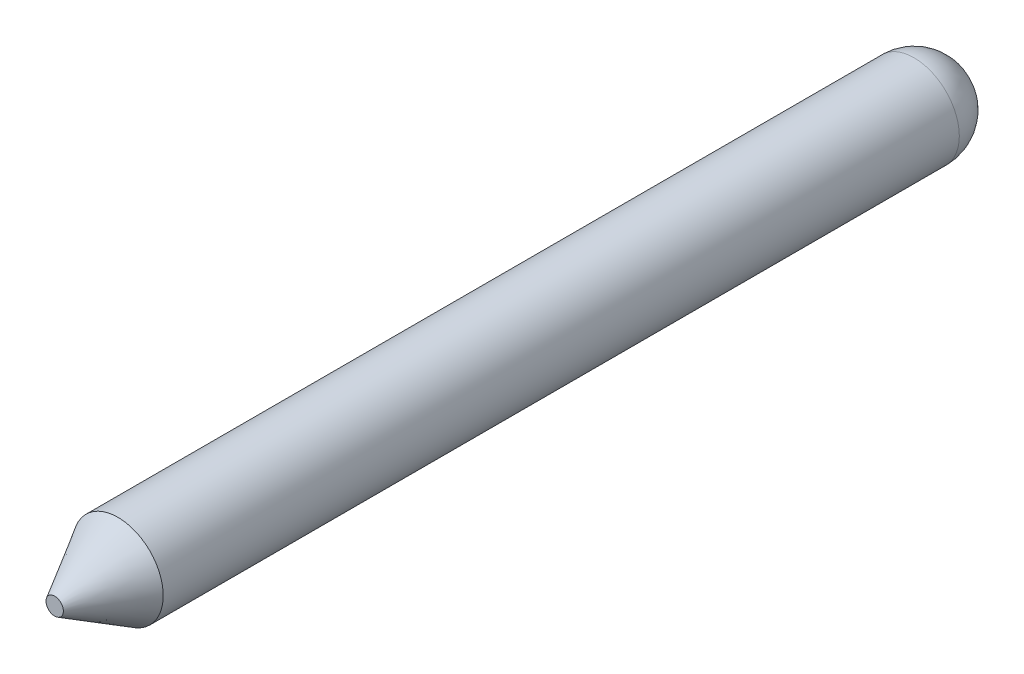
from build123d import *

# Parameters (mm, degrees)
SKETCH1_R          = 5
BASE_EXTRUDE_DEPTH = 100
FILLET1_R          = 5
CHAMFER1_SIZE      = 7
CHAMFER1_SIZE2     = 4.041451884


with BuildPart() as part:
    # Sketch1 → Base-Extrude (new body)
    with BuildSketch(Plane.XY):
        Circle(SKETCH1_R)
    extrude(amount=BASE_EXTRUDE_DEPTH)

    # Fillet1
    fillet1_edges = [part.edges().sort_by_distance(p)[0] for p in [
        (-5, 0, 0),
    ]]
    fillet(fillet1_edges, radius=FILLET1_R)

    # Chamfer1
    chamfer1_edges = [part.edges().sort_by_distance(p)[0] for p in [
        (-5, 0, 100),
    ]]
    chamfer1_side = [part.faces().sort_by_distance(p)[0] for p in [
        (-5, 0, 52.5),
    ]]
    chamfer(chamfer1_edges, length=CHAMFER1_SIZE, length2=CHAMFER1_SIZE2, reference=chamfer1_side[0])


solid = part.part
